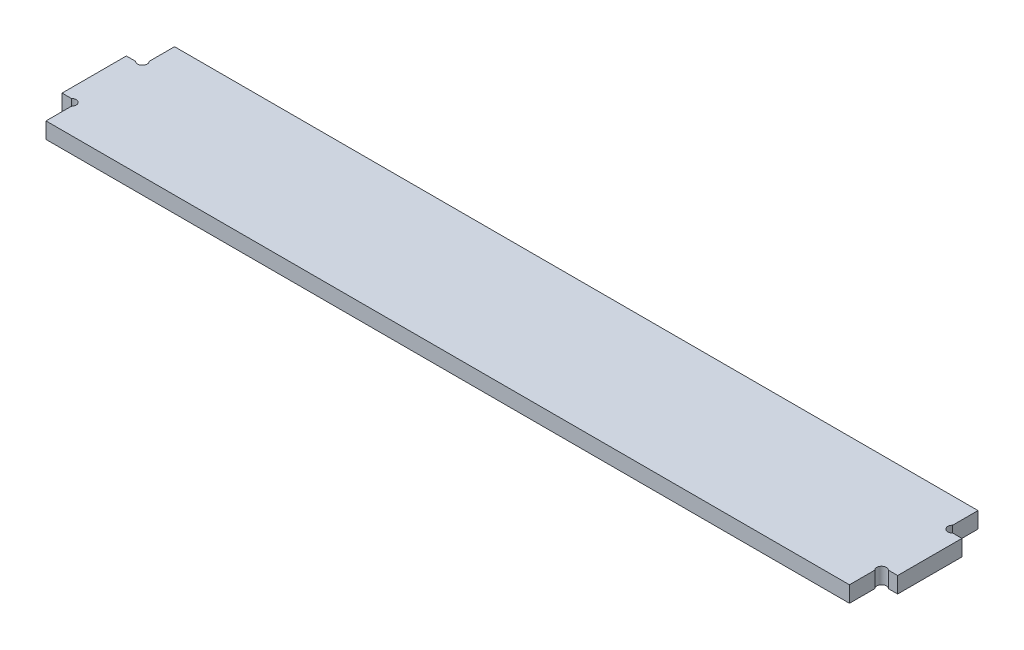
ISO-10303-21;
HEADER;
FILE_DESCRIPTION(('STEP AP214'),'2;1');
FILE_NAME('part.step','',(''),(''),'','','');
FILE_SCHEMA(('AUTOMOTIVE_DESIGN { 1 0 10303 214 1 1 1 1 }'));
ENDSEC;
DATA;
#1=APPLICATION_CONTEXT('core data for automotive mechanical design processes');
#2=APPLICATION_PROTOCOL_DEFINITION('international standard','automotive_design',2000,#1);
#3=PRODUCT_CONTEXT('',#1,'mechanical');
#4=PRODUCT('Part','Part','',(#3));
#5=PRODUCT_RELATED_PRODUCT_CATEGORY('part','',(#4));
#6=PRODUCT_DEFINITION_FORMATION('','',#4);
#7=PRODUCT_DEFINITION_CONTEXT('part definition',#1,'design');
#8=PRODUCT_DEFINITION('design','',#6,#7);
#9=PRODUCT_DEFINITION_SHAPE('','',#8);
#10=(LENGTH_UNIT() NAMED_UNIT(*) SI_UNIT(.MILLI.,.METRE.));
#11=(NAMED_UNIT(*) PLANE_ANGLE_UNIT() SI_UNIT($,.RADIAN.));
#12=(NAMED_UNIT(*) SI_UNIT($,.STERADIAN.) SOLID_ANGLE_UNIT());
#13=UNCERTAINTY_MEASURE_WITH_UNIT(LENGTH_MEASURE(1.E-05),#10,'distance_accuracy_value','');
#14=(GEOMETRIC_REPRESENTATION_CONTEXT(3) GLOBAL_UNCERTAINTY_ASSIGNED_CONTEXT((#13)) GLOBAL_UNIT_ASSIGNED_CONTEXT((#10,
#11,#12)) REPRESENTATION_CONTEXT('',''));
#15=CARTESIAN_POINT('',(0.,0.,0.));
#16=DIRECTION('',(0.,0.,1.));
#17=DIRECTION('',(1.,0.,0.));
#18=AXIS2_PLACEMENT_3D('',#15,#16,#17);
#19=CARTESIAN_POINT('',(0.,173.639844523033,80.));
#20=DIRECTION('',(-1.,0.,0.));
#21=DIRECTION('',(0.,-1.,0.));
#22=AXIS2_PLACEMENT_3D('',#19,#20,#21);
#23=PLANE('',#22);
#24=DIRECTION('',(0.,1.,0.));
#25=VECTOR('',#24,1.);
#26=CARTESIAN_POINT('',(0.,163.639844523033,15.7573593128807));
#27=LINE('',#26,#25);
#28=CARTESIAN_POINT('',(0.,163.639844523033,15.7573593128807));
#29=VERTEX_POINT('',#28);
#30=CARTESIAN_POINT('',(0.,173.639844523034,15.7573593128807));
#31=VERTEX_POINT('',#30);
#32=EDGE_CURVE('E167',#29,#31,#27,.T.);
#33=ORIENTED_EDGE('',*,*,#32,.F.);
#34=DIRECTION('',(0.,0.,-1.));
#35=VECTOR('',#34,1.);
#36=CARTESIAN_POINT('',(0.,163.639844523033,80.));
#37=LINE('',#36,#35);
#38=CARTESIAN_POINT('',(0.,163.639844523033,0.));
#39=VERTEX_POINT('',#38);
#40=EDGE_CURVE('E246',#29,#39,#37,.T.);
#41=ORIENTED_EDGE('',*,*,#40,.T.);
#42=DIRECTION('',(0.,1.,0.));
#43=VECTOR('',#42,1.);
#44=CARTESIAN_POINT('',(0.,173.639844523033,0.));
#45=LINE('',#44,#43);
#46=CARTESIAN_POINT('',(0.,173.639844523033,0.));
#47=VERTEX_POINT('',#46);
#48=EDGE_CURVE('E236',#39,#47,#45,.T.);
#49=ORIENTED_EDGE('',*,*,#48,.T.);
#50=DIRECTION('',(0.,0.,-1.));
#51=VECTOR('',#50,1.);
#52=CARTESIAN_POINT('',(0.,173.639844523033,80.));
#53=LINE('',#52,#51);
#54=EDGE_CURVE('E244',#31,#47,#53,.T.);
#55=ORIENTED_EDGE('',*,*,#54,.F.);
#56=EDGE_LOOP('',(#33,#41,#49,#55));
#57=FACE_BOUND('',#56,.T.);
#58=ADVANCED_FACE('F33',(#57),#23,.F.);
#59=DIRECTION('',(0.,1.,0.));
#60=VECTOR('',#59,1.);
#61=CARTESIAN_POINT('',(0.,163.639844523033,64.2426406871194));
#62=LINE('',#61,#60);
#63=CARTESIAN_POINT('',(0.,173.639844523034,64.2426406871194));
#64=VERTEX_POINT('',#63);
#65=CARTESIAN_POINT('',(0.,163.639844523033,64.2426406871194));
#66=VERTEX_POINT('',#65);
#67=EDGE_CURVE('E171',#64,#66,#62,.F.);
#68=ORIENTED_EDGE('',*,*,#67,.F.);
#69=CARTESIAN_POINT('',(0.,173.639844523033,80.));
#70=VERTEX_POINT('',#69);
#71=EDGE_CURVE('E154',#70,#64,#53,.T.);
#72=ORIENTED_EDGE('',*,*,#71,.F.);
#73=DIRECTION('',(0.,1.,0.));
#74=VECTOR('',#73,1.);
#75=CARTESIAN_POINT('',(0.,173.639844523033,80.));
#76=LINE('',#75,#74);
#77=CARTESIAN_POINT('',(0.,163.639844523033,80.));
#78=VERTEX_POINT('',#77);
#79=EDGE_CURVE('E226',#78,#70,#76,.T.);
#80=ORIENTED_EDGE('',*,*,#79,.F.);
#81=EDGE_CURVE('E247',#78,#66,#37,.T.);
#82=ORIENTED_EDGE('',*,*,#81,.T.);
#83=EDGE_LOOP('',(#68,#72,#80,#82));
#84=FACE_BOUND('',#83,.T.);
#85=ADVANCED_FACE('F316',(#84),#23,.F.);
#86=CARTESIAN_POINT('',(0.,163.639844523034,20.));
#87=DIRECTION('',(0.,0.,1.));
#88=DIRECTION('',(1.,0.,0.));
#89=AXIS2_PLACEMENT_3D('',#86,#87,#88);
#90=PLANE('',#89);
#91=DIRECTION('',(0.,1.,0.));
#92=VECTOR('',#91,1.);
#93=CARTESIAN_POINT('',(4.2426406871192,163.639844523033,20.));
#94=LINE('',#93,#92);
#95=CARTESIAN_POINT('',(4.24264068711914,173.639844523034,20.));
#96=VERTEX_POINT('',#95);
#97=CARTESIAN_POINT('',(4.2426406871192,163.639844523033,20.));
#98=VERTEX_POINT('',#97);
#99=EDGE_CURVE('E11',#96,#98,#94,.F.);
#100=ORIENTED_EDGE('',*,*,#99,.F.);
#101=DIRECTION('',(1.,0.,0.));
#102=VECTOR('',#101,1.);
#103=CARTESIAN_POINT('',(-1.11022302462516E-13,173.639844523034,20.));
#104=LINE('',#103,#102);
#105=CARTESIAN_POINT('',(9.9999999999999,173.639844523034,20.));
#106=VERTEX_POINT('',#105);
#107=EDGE_CURVE('E169',#96,#106,#104,.T.);
#108=ORIENTED_EDGE('',*,*,#107,.T.);
#109=DIRECTION('',(0.,1.,0.));
#110=VECTOR('',#109,1.);
#111=CARTESIAN_POINT('',(9.99999999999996,163.639844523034,20.));
#112=LINE('',#111,#110);
#113=CARTESIAN_POINT('',(9.99999999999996,163.639844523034,20.));
#114=VERTEX_POINT('',#113);
#115=EDGE_CURVE('E179',#114,#106,#112,.T.);
#116=ORIENTED_EDGE('',*,*,#115,.F.);
#117=DIRECTION('',(1.,0.,0.));
#118=VECTOR('',#117,1.);
#119=CARTESIAN_POINT('',(0.,163.639844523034,20.));
#120=LINE('',#119,#118);
#121=EDGE_CURVE('E174',#98,#114,#120,.T.);
#122=ORIENTED_EDGE('',*,*,#121,.F.);
#123=EDGE_LOOP('',(#100,#108,#116,#122));
#124=FACE_BOUND('',#123,.T.);
#125=ADVANCED_FACE('F311',(#124),#90,.F.);
#126=CARTESIAN_POINT('',(0.,163.639844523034,60.));
#127=DIRECTION('',(0.,0.,-1.));
#128=DIRECTION('',(-1.,0.,0.));
#129=AXIS2_PLACEMENT_3D('',#126,#127,#128);
#130=PLANE('',#129);
#131=DIRECTION('',(0.,1.,0.));
#132=VECTOR('',#131,1.);
#133=CARTESIAN_POINT('',(4.24264068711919,163.639844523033,60.));
#134=LINE('',#133,#132);
#135=CARTESIAN_POINT('',(4.2426406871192,163.639844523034,60.));
#136=VERTEX_POINT('',#135);
#137=CARTESIAN_POINT('',(4.24264068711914,173.639844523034,60.));
#138=VERTEX_POINT('',#137);
#139=EDGE_CURVE('E41',#136,#138,#134,.T.);
#140=ORIENTED_EDGE('',*,*,#139,.F.);
#141=DIRECTION('',(-1.,0.,0.));
#142=VECTOR('',#141,1.);
#143=CARTESIAN_POINT('',(0.,163.639844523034,60.));
#144=LINE('',#143,#142);
#145=CARTESIAN_POINT('',(9.99999999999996,163.639844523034,60.));
#146=VERTEX_POINT('',#145);
#147=EDGE_CURVE('E178',#146,#136,#144,.T.);
#148=ORIENTED_EDGE('',*,*,#147,.F.);
#149=DIRECTION('',(0.,1.,0.));
#150=VECTOR('',#149,1.);
#151=CARTESIAN_POINT('',(9.99999999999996,163.639844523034,60.));
#152=LINE('',#151,#150);
#153=CARTESIAN_POINT('',(9.9999999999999,173.639844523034,60.));
#154=VERTEX_POINT('',#153);
#155=EDGE_CURVE('E165',#146,#154,#152,.T.);
#156=ORIENTED_EDGE('',*,*,#155,.T.);
#157=DIRECTION('',(-1.,0.,0.));
#158=VECTOR('',#157,1.);
#159=CARTESIAN_POINT('',(-1.11022302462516E-13,173.639844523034,60.));
#160=LINE('',#159,#158);
#161=EDGE_CURVE('E151',#154,#138,#160,.T.);
#162=ORIENTED_EDGE('',*,*,#161,.T.);
#163=EDGE_LOOP('',(#140,#148,#156,#162));
#164=FACE_BOUND('',#163,.T.);
#165=ADVANCED_FACE('F163',(#164),#130,.F.);
#166=CARTESIAN_POINT('',(-500.,173.639844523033,80.));
#167=DIRECTION('',(1.,0.,0.));
#168=DIRECTION('',(0.,0.,-1.));
#169=AXIS2_PLACEMENT_3D('',#166,#167,#168);
#170=PLANE('',#169);
#171=DIRECTION('',(0.,0.,-1.));
#172=VECTOR('',#171,1.);
#173=CARTESIAN_POINT('',(-500.,173.639844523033,80.));
#174=LINE('',#173,#172);
#175=CARTESIAN_POINT('',(-500.,173.639844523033,80.));
#176=VERTEX_POINT('',#175);
#177=CARTESIAN_POINT('',(-500.,173.639844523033,64.2426406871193));
#178=VERTEX_POINT('',#177);
#179=EDGE_CURVE('E241',#176,#178,#174,.T.);
#180=ORIENTED_EDGE('',*,*,#179,.T.);
#181=DIRECTION('',(0.,1.,0.));
#182=VECTOR('',#181,1.);
#183=CARTESIAN_POINT('',(-500.,163.639844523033,64.2426406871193));
#184=LINE('',#183,#182);
#185=CARTESIAN_POINT('',(-500.,163.639844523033,64.2426406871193));
#186=VERTEX_POINT('',#185);
#187=EDGE_CURVE('E195',#178,#186,#184,.F.);
#188=ORIENTED_EDGE('',*,*,#187,.T.);
#189=DIRECTION('',(0.,0.,-1.));
#190=VECTOR('',#189,1.);
#191=CARTESIAN_POINT('',(-500.,163.639844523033,80.));
#192=LINE('',#191,#190);
#193=CARTESIAN_POINT('',(-500.,163.639844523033,80.));
#194=VERTEX_POINT('',#193);
#195=EDGE_CURVE('E251',#194,#186,#192,.T.);
#196=ORIENTED_EDGE('',*,*,#195,.F.);
#197=DIRECTION('',(0.,-1.,0.));
#198=VECTOR('',#197,1.);
#199=CARTESIAN_POINT('',(-500.,173.639844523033,80.));
#200=LINE('',#199,#198);
#201=EDGE_CURVE('E220',#176,#194,#200,.T.);
#202=ORIENTED_EDGE('',*,*,#201,.F.);
#203=EDGE_LOOP('',(#180,#188,#196,#202));
#204=FACE_BOUND('',#203,.T.);
#205=ADVANCED_FACE('F274',(#204),#170,.F.);
#206=CARTESIAN_POINT('',(-500.,163.639844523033,15.7573593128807));
#207=VERTEX_POINT('',#206);
#208=CARTESIAN_POINT('',(-500.,163.639844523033,0.));
#209=VERTEX_POINT('',#208);
#210=EDGE_CURVE('E250',#207,#209,#192,.T.);
#211=ORIENTED_EDGE('',*,*,#210,.F.);
#212=DIRECTION('',(0.,1.,0.));
#213=VECTOR('',#212,1.);
#214=CARTESIAN_POINT('',(-500.,163.639844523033,15.7573593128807));
#215=LINE('',#214,#213);
#216=CARTESIAN_POINT('',(-500.,173.639844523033,15.7573593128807));
#217=VERTEX_POINT('',#216);
#218=EDGE_CURVE('E187',#207,#217,#215,.T.);
#219=ORIENTED_EDGE('',*,*,#218,.T.);
#220=CARTESIAN_POINT('',(-500.,173.639844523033,0.));
#221=VERTEX_POINT('',#220);
#222=EDGE_CURVE('E230',#217,#221,#174,.T.);
#223=ORIENTED_EDGE('',*,*,#222,.T.);
#224=DIRECTION('',(0.,-1.,0.));
#225=VECTOR('',#224,1.);
#226=CARTESIAN_POINT('',(-500.,173.639844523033,0.));
#227=LINE('',#226,#225);
#228=EDGE_CURVE('E217',#221,#209,#227,.T.);
#229=ORIENTED_EDGE('',*,*,#228,.T.);
#230=EDGE_LOOP('',(#211,#219,#223,#229));
#231=FACE_BOUND('',#230,.T.);
#232=ADVANCED_FACE('F35',(#231),#170,.F.);
#233=CARTESIAN_POINT('',(-500.,163.639844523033,80.));
#234=DIRECTION('',(0.,1.,0.));
#235=DIRECTION('',(0.,0.,1.));
#236=AXIS2_PLACEMENT_3D('',#233,#234,#235);
#237=PLANE('',#236);
#238=CARTESIAN_POINT('',(2.12132034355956,163.639844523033,17.8786796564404));
#239=DIRECTION('',(0.,-1.,0.));
#240=DIRECTION('',(0.,0.,1.));
#241=AXIS2_PLACEMENT_3D('',#238,#239,#240);
#242=CIRCLE('',#241,2.99999999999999);
#243=EDGE_CURVE('E295',#98,#29,#242,.T.);
#244=ORIENTED_EDGE('',*,*,#243,.F.);
#245=ORIENTED_EDGE('',*,*,#121,.T.);
#246=DIRECTION('',(0.,0.,1.));
#247=VECTOR('',#246,1.);
#248=CARTESIAN_POINT('',(9.99999999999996,163.639844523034,60.));
#249=LINE('',#248,#247);
#250=EDGE_CURVE('E306',#114,#146,#249,.T.);
#251=ORIENTED_EDGE('',*,*,#250,.T.);
#252=ORIENTED_EDGE('',*,*,#147,.T.);
#253=CARTESIAN_POINT('',(2.12132034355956,163.639844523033,62.1213203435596));
#254=DIRECTION('',(0.,-1.,0.));
#255=DIRECTION('',(0.,0.,-1.));
#256=AXIS2_PLACEMENT_3D('',#253,#254,#255);
#257=CIRCLE('',#256,2.99999999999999);
#258=EDGE_CURVE('E55',#66,#136,#257,.T.);
#259=ORIENTED_EDGE('',*,*,#258,.F.);
#260=ORIENTED_EDGE('',*,*,#81,.F.);
#261=DIRECTION('',(1.,0.,0.));
#262=VECTOR('',#261,1.);
#263=CARTESIAN_POINT('',(-500.,163.639844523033,80.));
#264=LINE('',#263,#262);
#265=EDGE_CURVE('E223',#194,#78,#264,.T.);
#266=ORIENTED_EDGE('',*,*,#265,.F.);
#267=ORIENTED_EDGE('',*,*,#195,.T.);
#268=CARTESIAN_POINT('',(-502.12132034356,163.639844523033,62.1213203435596));
#269=DIRECTION('',(0.,1.,0.));
#270=DIRECTION('',(0.,0.,-1.));
#271=AXIS2_PLACEMENT_3D('',#268,#269,#270);
#272=CIRCLE('',#271,2.99999999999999);
#273=CARTESIAN_POINT('',(-504.242640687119,163.639844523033,60.));
#274=VERTEX_POINT('',#273);
#275=EDGE_CURVE('E190',#186,#274,#272,.T.);
#276=ORIENTED_EDGE('',*,*,#275,.T.);
#277=DIRECTION('',(1.,0.,0.));
#278=VECTOR('',#277,1.);
#279=CARTESIAN_POINT('',(-500.,163.639844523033,60.));
#280=LINE('',#279,#278);
#281=CARTESIAN_POINT('',(-510.,163.639844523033,60.));
#282=VERTEX_POINT('',#281);
#283=EDGE_CURVE('E205',#282,#274,#280,.T.);
#284=ORIENTED_EDGE('',*,*,#283,.F.);
#285=DIRECTION('',(0.,0.,1.));
#286=VECTOR('',#285,1.);
#287=CARTESIAN_POINT('',(-510.,163.639844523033,60.));
#288=LINE('',#287,#286);
#289=CARTESIAN_POINT('',(-510.,163.639844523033,20.));
#290=VERTEX_POINT('',#289);
#291=EDGE_CURVE('E201',#290,#282,#288,.T.);
#292=ORIENTED_EDGE('',*,*,#291,.F.);
#293=DIRECTION('',(-1.,0.,0.));
#294=VECTOR('',#293,1.);
#295=CARTESIAN_POINT('',(-500.,163.639844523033,20.));
#296=LINE('',#295,#294);
#297=CARTESIAN_POINT('',(-504.242640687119,163.639844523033,20.));
#298=VERTEX_POINT('',#297);
#299=EDGE_CURVE('E199',#298,#290,#296,.T.);
#300=ORIENTED_EDGE('',*,*,#299,.F.);
#301=CARTESIAN_POINT('',(-502.12132034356,163.639844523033,17.8786796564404));
#302=DIRECTION('',(0.,1.,0.));
#303=DIRECTION('',(0.,0.,1.));
#304=AXIS2_PLACEMENT_3D('',#301,#302,#303);
#305=CIRCLE('',#304,2.99999999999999);
#306=EDGE_CURVE('E184',#298,#207,#305,.T.);
#307=ORIENTED_EDGE('',*,*,#306,.T.);
#308=ORIENTED_EDGE('',*,*,#210,.T.);
#309=DIRECTION('',(1.,0.,0.));
#310=VECTOR('',#309,1.);
#311=CARTESIAN_POINT('',(-500.,163.639844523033,0.));
#312=LINE('',#311,#310);
#313=EDGE_CURVE('E233',#209,#39,#312,.T.);
#314=ORIENTED_EDGE('',*,*,#313,.T.);
#315=ORIENTED_EDGE('',*,*,#40,.F.);
#316=EDGE_LOOP('',(#244,#245,#251,#252,#259,#260,#266,#267,#276,#284,#292,#300,#307,#308,#314,#315));
#317=FACE_BOUND('',#316,.T.);
#318=ADVANCED_FACE('F268',(#317),#237,.F.);
#319=CARTESIAN_POINT('',(-500.,173.639844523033,80.));
#320=DIRECTION('',(0.,-1.,0.));
#321=DIRECTION('',(0.,0.,-1.));
#322=AXIS2_PLACEMENT_3D('',#319,#320,#321);
#323=PLANE('',#322);
#324=CARTESIAN_POINT('',(2.1213203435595,173.639844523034,17.8786796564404));
#325=DIRECTION('',(0.,-1.,0.));
#326=DIRECTION('',(0.,0.,1.));
#327=AXIS2_PLACEMENT_3D('',#324,#325,#326);
#328=CIRCLE('',#327,2.99999999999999);
#329=EDGE_CURVE('E47',#96,#31,#328,.T.);
#330=ORIENTED_EDGE('',*,*,#329,.T.);
#331=ORIENTED_EDGE('',*,*,#54,.T.);
#332=DIRECTION('',(-1.,0.,0.));
#333=VECTOR('',#332,1.);
#334=CARTESIAN_POINT('',(-500.,173.639844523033,0.));
#335=LINE('',#334,#333);
#336=EDGE_CURVE('E224',#47,#221,#335,.T.);
#337=ORIENTED_EDGE('',*,*,#336,.T.);
#338=ORIENTED_EDGE('',*,*,#222,.F.);
#339=CARTESIAN_POINT('',(-502.12132034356,173.639844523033,17.8786796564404));
#340=DIRECTION('',(0.,1.,0.));
#341=DIRECTION('',(0.,0.,1.));
#342=AXIS2_PLACEMENT_3D('',#339,#340,#341);
#343=CIRCLE('',#342,2.99999999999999);
#344=CARTESIAN_POINT('',(-504.242640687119,173.639844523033,20.));
#345=VERTEX_POINT('',#344);
#346=EDGE_CURVE('E188',#345,#217,#343,.T.);
#347=ORIENTED_EDGE('',*,*,#346,.F.);
#348=DIRECTION('',(-1.,0.,0.));
#349=VECTOR('',#348,1.);
#350=CARTESIAN_POINT('',(-500.,173.639844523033,20.));
#351=LINE('',#350,#349);
#352=CARTESIAN_POINT('',(-510.,173.639844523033,20.));
#353=VERTEX_POINT('',#352);
#354=EDGE_CURVE('E198',#345,#353,#351,.T.);
#355=ORIENTED_EDGE('',*,*,#354,.T.);
#356=DIRECTION('',(0.,0.,1.));
#357=VECTOR('',#356,1.);
#358=CARTESIAN_POINT('',(-510.,173.639844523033,60.));
#359=LINE('',#358,#357);
#360=CARTESIAN_POINT('',(-510.,173.639844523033,60.));
#361=VERTEX_POINT('',#360);
#362=EDGE_CURVE('E210',#353,#361,#359,.T.);
#363=ORIENTED_EDGE('',*,*,#362,.T.);
#364=DIRECTION('',(1.,0.,0.));
#365=VECTOR('',#364,1.);
#366=CARTESIAN_POINT('',(-500.,173.639844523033,60.));
#367=LINE('',#366,#365);
#368=CARTESIAN_POINT('',(-504.242640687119,173.639844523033,60.));
#369=VERTEX_POINT('',#368);
#370=EDGE_CURVE('E202',#361,#369,#367,.T.);
#371=ORIENTED_EDGE('',*,*,#370,.T.);
#372=CARTESIAN_POINT('',(-502.12132034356,173.639844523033,62.1213203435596));
#373=DIRECTION('',(0.,1.,0.));
#374=DIRECTION('',(0.,0.,-1.));
#375=AXIS2_PLACEMENT_3D('',#372,#373,#374);
#376=CIRCLE('',#375,2.99999999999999);
#377=EDGE_CURVE('E182',#178,#369,#376,.T.);
#378=ORIENTED_EDGE('',*,*,#377,.F.);
#379=ORIENTED_EDGE('',*,*,#179,.F.);
#380=DIRECTION('',(-1.,0.,0.));
#381=VECTOR('',#380,1.);
#382=CARTESIAN_POINT('',(-500.,173.639844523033,80.));
#383=LINE('',#382,#381);
#384=EDGE_CURVE('E228',#70,#176,#383,.T.);
#385=ORIENTED_EDGE('',*,*,#384,.F.);
#386=ORIENTED_EDGE('',*,*,#71,.T.);
#387=CARTESIAN_POINT('',(2.1213203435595,173.639844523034,62.1213203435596));
#388=DIRECTION('',(0.,-1.,0.));
#389=DIRECTION('',(0.,0.,-1.));
#390=AXIS2_PLACEMENT_3D('',#387,#388,#389);
#391=CIRCLE('',#390,2.99999999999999);
#392=EDGE_CURVE('E147',#64,#138,#391,.T.);
#393=ORIENTED_EDGE('',*,*,#392,.T.);
#394=ORIENTED_EDGE('',*,*,#161,.F.);
#395=DIRECTION('',(0.,0.,1.));
#396=VECTOR('',#395,1.);
#397=CARTESIAN_POINT('',(9.9999999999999,173.639844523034,60.));
#398=LINE('',#397,#396);
#399=EDGE_CURVE('E166',#106,#154,#398,.T.);
#400=ORIENTED_EDGE('',*,*,#399,.F.);
#401=ORIENTED_EDGE('',*,*,#107,.F.);
#402=EDGE_LOOP('',(#330,#331,#337,#338,#347,#355,#363,#371,#378,#379,#385,#386,#393,#394,#400,#401));
#403=FACE_BOUND('',#402,.T.);
#404=ADVANCED_FACE('F148',(#403),#323,.F.);
#405=CARTESIAN_POINT('',(0.,0.,80.));
#406=DIRECTION('',(0.,0.,1.));
#407=DIRECTION('',(1.,0.,0.));
#408=AXIS2_PLACEMENT_3D('',#405,#406,#407);
#409=PLANE('',#408);
#410=ORIENTED_EDGE('',*,*,#201,.T.);
#411=ORIENTED_EDGE('',*,*,#265,.T.);
#412=ORIENTED_EDGE('',*,*,#79,.T.);
#413=ORIENTED_EDGE('',*,*,#384,.T.);
#414=EDGE_LOOP('',(#410,#411,#412,#413));
#415=FACE_BOUND('',#414,.T.);
#416=ADVANCED_FACE('F318',(#415),#409,.T.);
#417=CARTESIAN_POINT('',(0.,0.,0.));
#418=DIRECTION('',(0.,0.,1.));
#419=DIRECTION('',(1.,0.,0.));
#420=AXIS2_PLACEMENT_3D('',#417,#418,#419);
#421=PLANE('',#420);
#422=ORIENTED_EDGE('',*,*,#228,.F.);
#423=ORIENTED_EDGE('',*,*,#336,.F.);
#424=ORIENTED_EDGE('',*,*,#48,.F.);
#425=ORIENTED_EDGE('',*,*,#313,.F.);
#426=EDGE_LOOP('',(#422,#423,#424,#425));
#427=FACE_BOUND('',#426,.T.);
#428=ADVANCED_FACE('F292',(#427),#421,.F.);
#429=CARTESIAN_POINT('',(-500.,163.639844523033,60.));
#430=DIRECTION('',(0.,0.,1.));
#431=DIRECTION('',(1.,0.,0.));
#432=AXIS2_PLACEMENT_3D('',#429,#430,#431);
#433=PLANE('',#432);
#434=DIRECTION('',(0.,1.,0.));
#435=VECTOR('',#434,1.);
#436=CARTESIAN_POINT('',(-504.242640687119,163.639844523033,60.));
#437=LINE('',#436,#435);
#438=EDGE_CURVE('E161',#369,#274,#437,.F.);
#439=ORIENTED_EDGE('',*,*,#438,.F.);
#440=ORIENTED_EDGE('',*,*,#370,.F.);
#441=DIRECTION('',(0.,1.,0.));
#442=VECTOR('',#441,1.);
#443=CARTESIAN_POINT('',(-510.,163.639844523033,60.));
#444=LINE('',#443,#442);
#445=EDGE_CURVE('E215',#282,#361,#444,.T.);
#446=ORIENTED_EDGE('',*,*,#445,.F.);
#447=ORIENTED_EDGE('',*,*,#283,.T.);
#448=EDGE_LOOP('',(#439,#440,#446,#447));
#449=FACE_BOUND('',#448,.T.);
#450=ADVANCED_FACE('F265',(#449),#433,.T.);
#451=CARTESIAN_POINT('',(-510.,163.639844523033,60.));
#452=DIRECTION('',(-1.,0.,0.));
#453=DIRECTION('',(0.,0.,1.));
#454=AXIS2_PLACEMENT_3D('',#451,#452,#453);
#455=PLANE('',#454);
#456=ORIENTED_EDGE('',*,*,#362,.F.);
#457=DIRECTION('',(0.,1.,0.));
#458=VECTOR('',#457,1.);
#459=CARTESIAN_POINT('',(-510.,163.639844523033,20.));
#460=LINE('',#459,#458);
#461=EDGE_CURVE('E208',#290,#353,#460,.T.);
#462=ORIENTED_EDGE('',*,*,#461,.F.);
#463=ORIENTED_EDGE('',*,*,#291,.T.);
#464=ORIENTED_EDGE('',*,*,#445,.T.);
#465=EDGE_LOOP('',(#456,#462,#463,#464));
#466=FACE_BOUND('',#465,.T.);
#467=ADVANCED_FACE('F280',(#466),#455,.T.);
#468=CARTESIAN_POINT('',(-500.,163.639844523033,20.));
#469=DIRECTION('',(0.,0.,-1.));
#470=DIRECTION('',(-1.,0.,0.));
#471=AXIS2_PLACEMENT_3D('',#468,#469,#470);
#472=PLANE('',#471);
#473=DIRECTION('',(0.,1.,0.));
#474=VECTOR('',#473,1.);
#475=CARTESIAN_POINT('',(-504.242640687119,163.639844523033,20.));
#476=LINE('',#475,#474);
#477=EDGE_CURVE('E254',#298,#345,#476,.T.);
#478=ORIENTED_EDGE('',*,*,#477,.F.);
#479=ORIENTED_EDGE('',*,*,#299,.T.);
#480=ORIENTED_EDGE('',*,*,#461,.T.);
#481=ORIENTED_EDGE('',*,*,#354,.F.);
#482=EDGE_LOOP('',(#478,#479,#480,#481));
#483=FACE_BOUND('',#482,.T.);
#484=ADVANCED_FACE('F283',(#483),#472,.T.);
#485=CARTESIAN_POINT('',(-502.12132034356,163.639844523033,17.8786796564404));
#486=DIRECTION('',(0.,1.,0.));
#487=DIRECTION('',(0.,0.,1.));
#488=AXIS2_PLACEMENT_3D('',#485,#486,#487);
#489=CYLINDRICAL_SURFACE('',#488,2.99999999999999);
#490=ORIENTED_EDGE('',*,*,#306,.F.);
#491=ORIENTED_EDGE('',*,*,#477,.T.);
#492=ORIENTED_EDGE('',*,*,#346,.T.);
#493=ORIENTED_EDGE('',*,*,#218,.F.);
#494=EDGE_LOOP('',(#490,#491,#492,#493));
#495=FACE_BOUND('',#494,.T.);
#496=ADVANCED_FACE('F350',(#495),#489,.F.);
#497=CARTESIAN_POINT('',(-502.12132034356,163.639844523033,62.1213203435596));
#498=DIRECTION('',(0.,1.,0.));
#499=DIRECTION('',(0.,0.,1.));
#500=AXIS2_PLACEMENT_3D('',#497,#498,#499);
#501=CYLINDRICAL_SURFACE('',#500,2.99999999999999);
#502=ORIENTED_EDGE('',*,*,#377,.T.);
#503=ORIENTED_EDGE('',*,*,#438,.T.);
#504=ORIENTED_EDGE('',*,*,#275,.F.);
#505=ORIENTED_EDGE('',*,*,#187,.F.);
#506=EDGE_LOOP('',(#502,#503,#504,#505));
#507=FACE_BOUND('',#506,.T.);
#508=ADVANCED_FACE('F260',(#507),#501,.F.);
#509=CARTESIAN_POINT('',(9.99999999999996,163.639844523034,60.));
#510=DIRECTION('',(-1.,0.,0.));
#511=DIRECTION('',(0.,-1.,0.));
#512=AXIS2_PLACEMENT_3D('',#509,#510,#511);
#513=PLANE('',#512);
#514=ORIENTED_EDGE('',*,*,#399,.T.);
#515=ORIENTED_EDGE('',*,*,#155,.F.);
#516=ORIENTED_EDGE('',*,*,#250,.F.);
#517=ORIENTED_EDGE('',*,*,#115,.T.);
#518=EDGE_LOOP('',(#514,#515,#516,#517));
#519=FACE_BOUND('',#518,.T.);
#520=ADVANCED_FACE('F313',(#519),#513,.F.);
#521=CARTESIAN_POINT('',(2.12132034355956,163.639844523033,62.1213203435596));
#522=DIRECTION('',(0.,1.,0.));
#523=DIRECTION('',(-1.,0.,0.));
#524=AXIS2_PLACEMENT_3D('',#521,#522,#523);
#525=CYLINDRICAL_SURFACE('',#524,2.99999999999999);
#526=ORIENTED_EDGE('',*,*,#67,.T.);
#527=ORIENTED_EDGE('',*,*,#258,.T.);
#528=ORIENTED_EDGE('',*,*,#139,.T.);
#529=ORIENTED_EDGE('',*,*,#392,.F.);
#530=EDGE_LOOP('',(#526,#527,#528,#529));
#531=FACE_BOUND('',#530,.T.);
#532=ADVANCED_FACE('F157',(#531),#525,.F.);
#533=CARTESIAN_POINT('',(2.12132034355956,163.639844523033,17.8786796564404));
#534=DIRECTION('',(0.,1.,0.));
#535=DIRECTION('',(-1.,0.,0.));
#536=AXIS2_PLACEMENT_3D('',#533,#534,#535);
#537=CYLINDRICAL_SURFACE('',#536,2.99999999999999);
#538=ORIENTED_EDGE('',*,*,#32,.T.);
#539=ORIENTED_EDGE('',*,*,#329,.F.);
#540=ORIENTED_EDGE('',*,*,#99,.T.);
#541=ORIENTED_EDGE('',*,*,#243,.T.);
#542=EDGE_LOOP('',(#538,#539,#540,#541));
#543=FACE_BOUND('',#542,.T.);
#544=ADVANCED_FACE('F299',(#543),#537,.F.);
#545=CLOSED_SHELL('',(#58,#85,#125,#165,#205,#232,#318,#404,#416,#428,#450,#467,#484,#496,#508,
#520,#532,#544));
#546=MANIFOLD_SOLID_BREP('B2',#545);
#547=ADVANCED_BREP_SHAPE_REPRESENTATION('',(#18,#546),#14);
#548=SHAPE_DEFINITION_REPRESENTATION(#9,#547);
ENDSEC;
END-ISO-10303-21;
